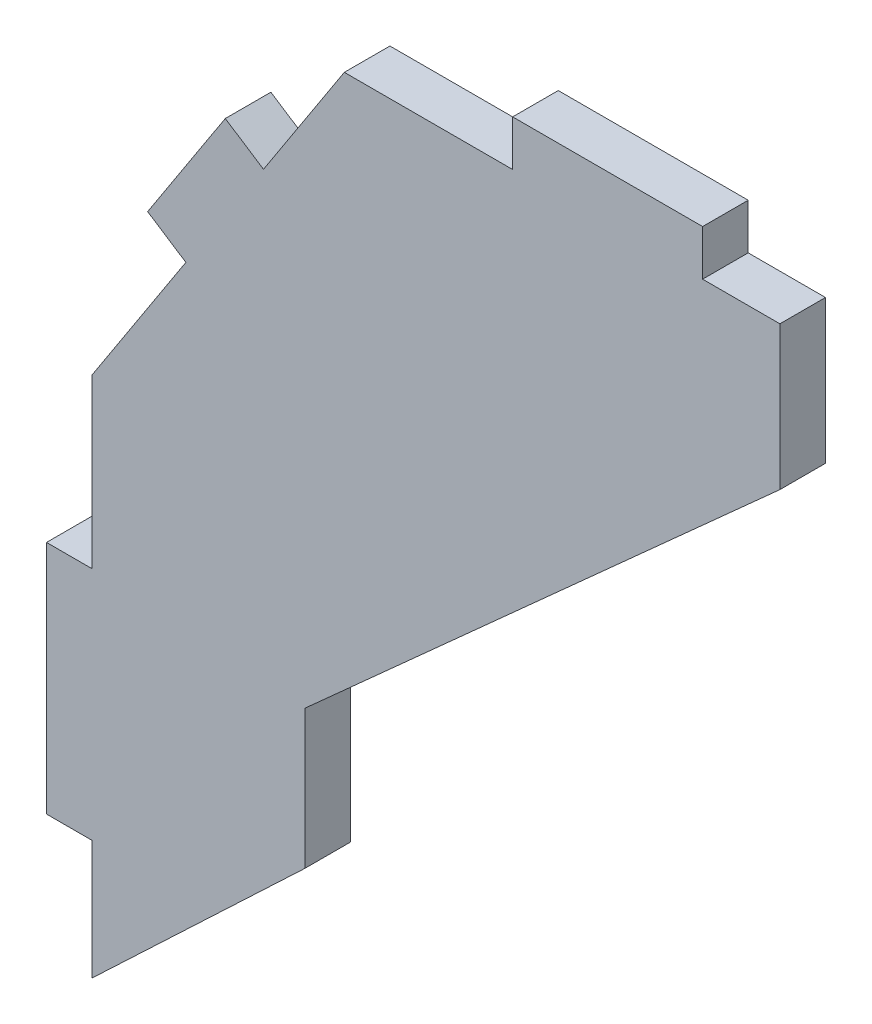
from build123d import *

# Parameters (mm, degrees)
BOSS_EXTRUDE1_DEPTH = 1.524


with BuildPart() as part:
    # Sketch1 → Boss-Extrude1 (new body)
    with BuildSketch(Plane.XY):
        Polygon((0, 171.841179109), (-1.524, 171.841179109), (-1.524, 163.976275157), (0, 163.976275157), (0, 159.993162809), (7.115866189, 166.725419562), (7.115866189, 171.36240882), (22.991703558, 185.627136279), (22.991703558, 190.428075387), (20.408510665, 190.428075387), (20.408510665, 191.952075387), (14.058510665, 191.952075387), (14.058510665, 190.428075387), (8.431414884, 190.428075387), (5.72978361, 186.270596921), (4.451893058, 187.101001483), (1.856878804, 183.107593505), (3.134769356, 182.277188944), (0, 177.453164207), align=None)
    extrude(amount=BOSS_EXTRUDE1_DEPTH)


solid = part.part
